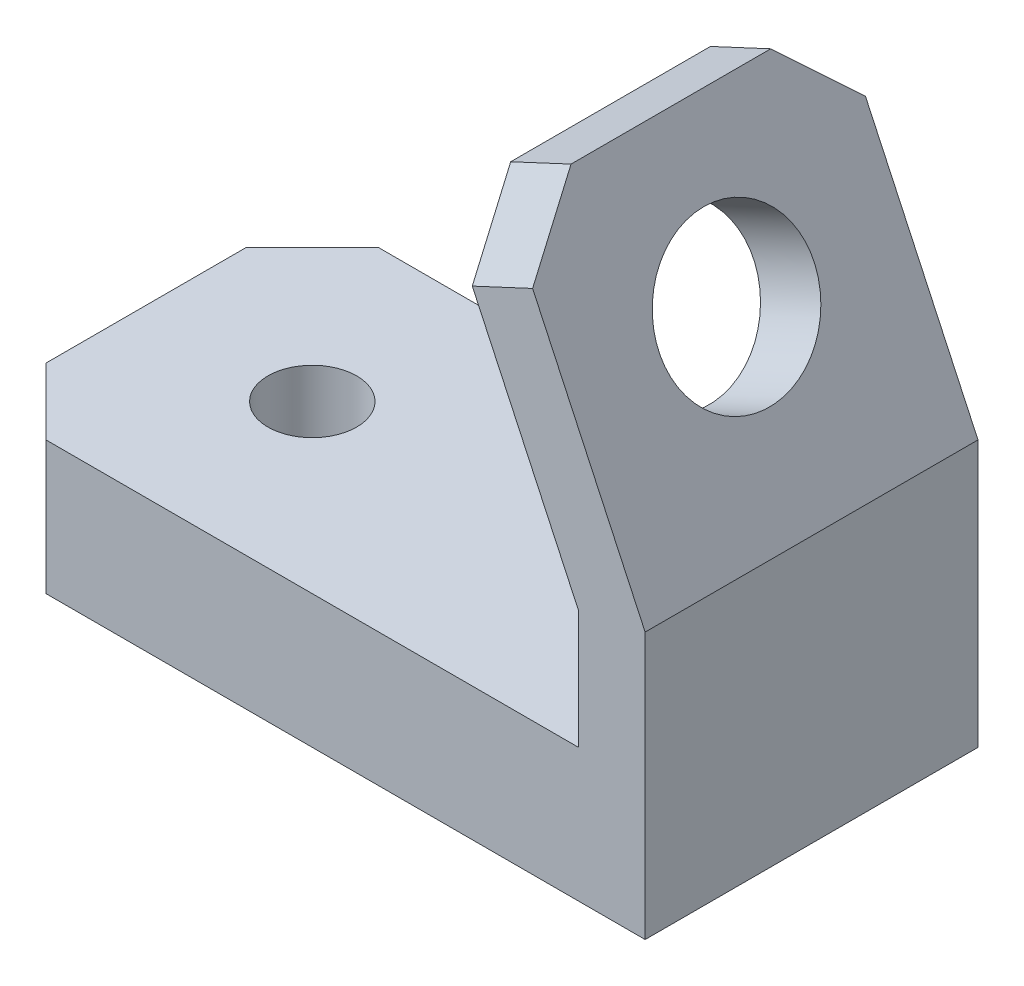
from build123d import *

# Parameters (mm, degrees)
AUFSATZ_LINEAR_AUSTRAGEN1_DEPTH    = 7.5
F_4_0_4_DURCHMESSER_BOHRUNG1_D     = 4
F_4_0_4_DURCHMESSER_BOHRUNG1_DEPTH = 6
F_7_0_7_DURCHMESSER_BOHRUNG1_D     = 7
F_7_0_7_DURCHMESSER_BOHRUNG1_DEPTH = 3
FASE1_SIZE                         = 3


with BuildPart() as part:
    # Skizze1 → Aufsatz-Linear austragen1 (new, symmetric)
    with BuildSketch(Plane.XY):
        Polygon((0, 0), (30, 0), (30, 12), (23.660726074, 25.594616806), (20.941802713, 24.32676202), (27, 11.334916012), (27, 6), (0, 6), align=None)
    extrude(amount=AUFSATZ_LINEAR_AUSTRAGEN1_DEPTH, both=True)

    # 4.0 _4_ Durchmesser Bohrung1
    with Locations(Plane(origin=(0, 0, 0), x_dir=(-1, 0, 0), z_dir=(0, -1, 0))):
        with Locations((-22.5, 0), (-7.5, 0)):
            Hole(F_4_0_4_DURCHMESSER_BOHRUNG1_D / 2, depth=F_4_0_4_DURCHMESSER_BOHRUNG1_DEPTH)

    # 7.0 _7_ Durchmesser Bohrung1
    with Locations(Plane(origin=(29.238080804, 13.633940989, 0), x_dir=(0, 0, -1), z_dir=(0.9063077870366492, 0.422618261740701, 0))):
        with Locations((0, 6.197145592)):
            Hole(F_7_0_7_DURCHMESSER_BOHRUNG1_D / 2, depth=F_7_0_7_DURCHMESSER_BOHRUNG1_DEPTH)

    # Fase1
    fase1_edges = [part.edges().sort_by_distance(p)[0] for p in [
        (0, 3, -7.5),
        (22.301264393, 24.960689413, 7.5),
        (0, 3, 7.5),
        (22.301264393, 24.960689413, -7.5),
    ]]
    chamfer(fase1_edges, length=FASE1_SIZE)


solid = part.part
